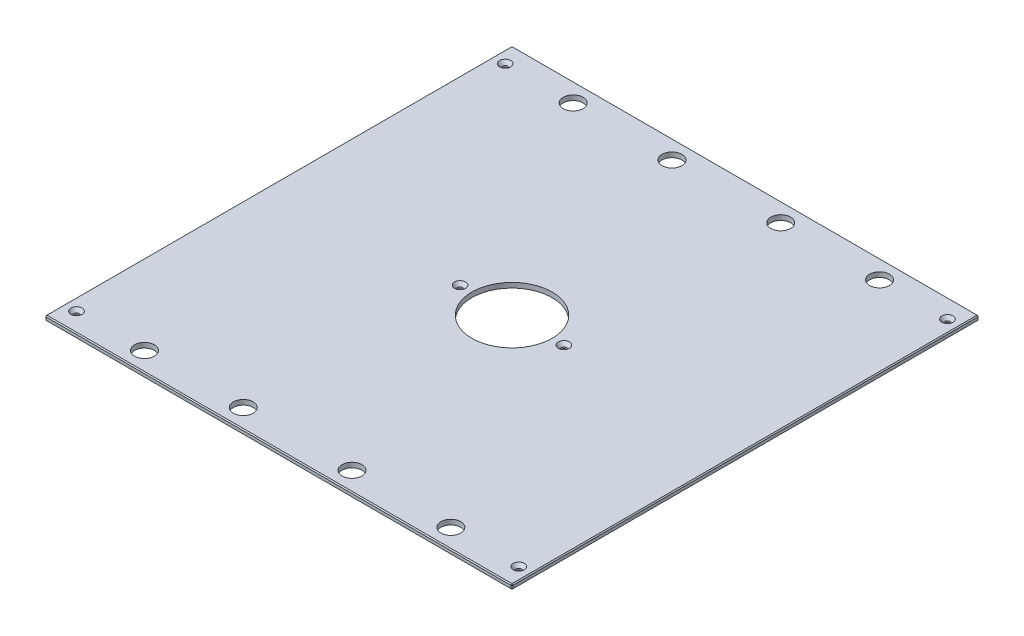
ISO-10303-21;
HEADER;
FILE_DESCRIPTION(('STEP AP214'),'2;1');
FILE_NAME('part.step','',(''),(''),'','','');
FILE_SCHEMA(('AUTOMOTIVE_DESIGN { 1 0 10303 214 1 1 1 1 }'));
ENDSEC;
DATA;
#1=APPLICATION_CONTEXT('core data for automotive mechanical design processes');
#2=APPLICATION_PROTOCOL_DEFINITION('international standard','automotive_design',2000,#1);
#3=PRODUCT_CONTEXT('',#1,'mechanical');
#4=PRODUCT('Part','Part','',(#3));
#5=PRODUCT_RELATED_PRODUCT_CATEGORY('part','',(#4));
#6=PRODUCT_DEFINITION_FORMATION('','',#4);
#7=PRODUCT_DEFINITION_CONTEXT('part definition',#1,'design');
#8=PRODUCT_DEFINITION('design','',#6,#7);
#9=PRODUCT_DEFINITION_SHAPE('','',#8);
#10=(LENGTH_UNIT() NAMED_UNIT(*) SI_UNIT(.MILLI.,.METRE.));
#11=(NAMED_UNIT(*) PLANE_ANGLE_UNIT() SI_UNIT($,.RADIAN.));
#12=(NAMED_UNIT(*) SI_UNIT($,.STERADIAN.) SOLID_ANGLE_UNIT());
#13=UNCERTAINTY_MEASURE_WITH_UNIT(LENGTH_MEASURE(1.E-05),#10,'distance_accuracy_value','');
#14=(GEOMETRIC_REPRESENTATION_CONTEXT(3) GLOBAL_UNCERTAINTY_ASSIGNED_CONTEXT((#13)) GLOBAL_UNIT_ASSIGNED_CONTEXT((#10,
#11,#12)) REPRESENTATION_CONTEXT('',''));
#15=CARTESIAN_POINT('',(0.,0.,0.));
#16=DIRECTION('',(0.,0.,1.));
#17=DIRECTION('',(1.,0.,0.));
#18=AXIS2_PLACEMENT_3D('',#15,#16,#17);
#19=CARTESIAN_POINT('',(-300.0375,6.35,-300.0375));
#20=DIRECTION('',(1.,0.,0.));
#21=DIRECTION('',(0.,0.,-1.));
#22=AXIS2_PLACEMENT_3D('',#19,#20,#21);
#23=PLANE('',#22);
#24=DIRECTION('',(0.,0.,-1.));
#25=VECTOR('',#24,1.);
#26=CARTESIAN_POINT('',(-300.0375,5.08000000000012,-300.0375));
#27=LINE('',#26,#25);
#28=CARTESIAN_POINT('',(-300.0375,5.08000000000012,298.7675));
#29=VERTEX_POINT('',#28);
#30=CARTESIAN_POINT('',(-300.0375,5.08000000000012,-298.7675));
#31=VERTEX_POINT('',#30);
#32=EDGE_CURVE('E134',#29,#31,#27,.T.);
#33=ORIENTED_EDGE('',*,*,#32,.T.);
#34=DIRECTION('',(0.,-1.,0.));
#35=VECTOR('',#34,1.);
#36=CARTESIAN_POINT('',(-300.0375,6.35,-298.7675));
#37=LINE('',#36,#35);
#38=CARTESIAN_POINT('',(-300.0375,1.26999999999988,-298.7675));
#39=VERTEX_POINT('',#38);
#40=EDGE_CURVE('E130',#31,#39,#37,.T.);
#41=ORIENTED_EDGE('',*,*,#40,.T.);
#42=DIRECTION('',(0.,0.,1.));
#43=VECTOR('',#42,1.);
#44=CARTESIAN_POINT('',(-300.0375,1.26999999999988,-300.0375));
#45=LINE('',#44,#43);
#46=CARTESIAN_POINT('',(-300.0375,1.26999999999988,298.7675));
#47=VERTEX_POINT('',#46);
#48=EDGE_CURVE('E125',#39,#47,#45,.T.);
#49=ORIENTED_EDGE('',*,*,#48,.T.);
#50=DIRECTION('',(0.,1.,0.));
#51=VECTOR('',#50,1.);
#52=CARTESIAN_POINT('',(-300.0375,6.35,298.7675));
#53=LINE('',#52,#51);
#54=EDGE_CURVE('E127',#47,#29,#53,.T.);
#55=ORIENTED_EDGE('',*,*,#54,.T.);
#56=EDGE_LOOP('',(#33,#41,#49,#55));
#57=FACE_BOUND('',#56,.T.);
#58=ADVANCED_FACE('F34',(#57),#23,.F.);
#59=CARTESIAN_POINT('',(-300.0375,6.35,300.0375));
#60=DIRECTION('',(0.,0.,-1.));
#61=DIRECTION('',(-1.,0.,0.));
#62=AXIS2_PLACEMENT_3D('',#59,#60,#61);
#63=PLANE('',#62);
#64=DIRECTION('',(1.,0.,0.));
#65=VECTOR('',#64,1.);
#66=CARTESIAN_POINT('',(-300.0375,1.26999999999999,300.0375));
#67=LINE('',#66,#65);
#68=CARTESIAN_POINT('',(-298.7675,1.26999999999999,300.0375));
#69=VERTEX_POINT('',#68);
#70=CARTESIAN_POINT('',(298.7675,1.26999999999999,300.0375));
#71=VERTEX_POINT('',#70);
#72=EDGE_CURVE('E57',#69,#71,#67,.T.);
#73=ORIENTED_EDGE('',*,*,#72,.T.);
#74=DIRECTION('',(0.,1.,0.));
#75=VECTOR('',#74,1.);
#76=CARTESIAN_POINT('',(298.7675,6.35,300.0375));
#77=LINE('',#76,#75);
#78=CARTESIAN_POINT('',(298.7675,5.08000000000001,300.0375));
#79=VERTEX_POINT('',#78);
#80=EDGE_CURVE('E11',#71,#79,#77,.T.);
#81=ORIENTED_EDGE('',*,*,#80,.T.);
#82=DIRECTION('',(-1.,0.,0.));
#83=VECTOR('',#82,1.);
#84=CARTESIAN_POINT('',(-300.0375,5.08000000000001,300.0375));
#85=LINE('',#84,#83);
#86=CARTESIAN_POINT('',(-298.7675,5.08000000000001,300.0375));
#87=VERTEX_POINT('',#86);
#88=EDGE_CURVE('E43',#79,#87,#85,.T.);
#89=ORIENTED_EDGE('',*,*,#88,.T.);
#90=DIRECTION('',(0.,-1.,0.));
#91=VECTOR('',#90,1.);
#92=CARTESIAN_POINT('',(-298.7675,6.35,300.0375));
#93=LINE('',#92,#91);
#94=EDGE_CURVE('E302',#87,#69,#93,.T.);
#95=ORIENTED_EDGE('',*,*,#94,.T.);
#96=EDGE_LOOP('',(#73,#81,#89,#95));
#97=FACE_BOUND('',#96,.T.);
#98=ADVANCED_FACE('F371',(#97),#63,.F.);
#99=CARTESIAN_POINT('',(300.0375,6.35,-300.0375));
#100=DIRECTION('',(-1.,0.,0.));
#101=DIRECTION('',(0.,0.,1.));
#102=AXIS2_PLACEMENT_3D('',#99,#100,#101);
#103=PLANE('',#102);
#104=DIRECTION('',(0.,0.,-1.));
#105=VECTOR('',#104,1.);
#106=CARTESIAN_POINT('',(300.0375,1.26999999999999,-300.0375));
#107=LINE('',#106,#105);
#108=CARTESIAN_POINT('',(300.0375,1.26999999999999,298.7675));
#109=VERTEX_POINT('',#108);
#110=CARTESIAN_POINT('',(300.0375,1.26999999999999,-298.7675));
#111=VERTEX_POINT('',#110);
#112=EDGE_CURVE('E297',#109,#111,#107,.T.);
#113=ORIENTED_EDGE('',*,*,#112,.T.);
#114=DIRECTION('',(0.,1.,0.));
#115=VECTOR('',#114,1.);
#116=CARTESIAN_POINT('',(300.0375,6.35,-298.7675));
#117=LINE('',#116,#115);
#118=CARTESIAN_POINT('',(300.0375,5.08000000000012,-298.7675));
#119=VERTEX_POINT('',#118);
#120=EDGE_CURVE('E299',#111,#119,#117,.T.);
#121=ORIENTED_EDGE('',*,*,#120,.T.);
#122=DIRECTION('',(0.,0.,1.));
#123=VECTOR('',#122,1.);
#124=CARTESIAN_POINT('',(300.0375,5.08000000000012,300.0375));
#125=LINE('',#124,#123);
#126=CARTESIAN_POINT('',(300.0375,5.08000000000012,298.7675));
#127=VERTEX_POINT('',#126);
#128=EDGE_CURVE('E295',#119,#127,#125,.T.);
#129=ORIENTED_EDGE('',*,*,#128,.T.);
#130=DIRECTION('',(0.,-1.,0.));
#131=VECTOR('',#130,1.);
#132=CARTESIAN_POINT('',(300.0375,6.35,298.7675));
#133=LINE('',#132,#131);
#134=EDGE_CURVE('E293',#127,#109,#133,.T.);
#135=ORIENTED_EDGE('',*,*,#134,.T.);
#136=EDGE_LOOP('',(#113,#121,#129,#135));
#137=FACE_BOUND('',#136,.T.);
#138=ADVANCED_FACE('F358',(#137),#103,.F.);
#139=CARTESIAN_POINT('',(-300.0375,6.35,-300.0375));
#140=DIRECTION('',(0.,0.,1.));
#141=DIRECTION('',(1.,0.,0.));
#142=AXIS2_PLACEMENT_3D('',#139,#140,#141);
#143=PLANE('',#142);
#144=DIRECTION('',(-1.,0.,0.));
#145=VECTOR('',#144,1.);
#146=CARTESIAN_POINT('',(-300.0375,1.26999999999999,-300.0375));
#147=LINE('',#146,#145);
#148=CARTESIAN_POINT('',(298.7675,1.26999999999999,-300.0375));
#149=VERTEX_POINT('',#148);
#150=CARTESIAN_POINT('',(-298.7675,1.26999999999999,-300.0375));
#151=VERTEX_POINT('',#150);
#152=EDGE_CURVE('E269',#149,#151,#147,.T.);
#153=ORIENTED_EDGE('',*,*,#152,.T.);
#154=DIRECTION('',(0.,1.,0.));
#155=VECTOR('',#154,1.);
#156=CARTESIAN_POINT('',(-298.7675,6.35,-300.0375));
#157=LINE('',#156,#155);
#158=CARTESIAN_POINT('',(-298.7675,5.08000000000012,-300.0375));
#159=VERTEX_POINT('',#158);
#160=EDGE_CURVE('E273',#151,#159,#157,.T.);
#161=ORIENTED_EDGE('',*,*,#160,.T.);
#162=DIRECTION('',(1.,0.,0.));
#163=VECTOR('',#162,1.);
#164=CARTESIAN_POINT('',(300.0375,5.08000000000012,-300.0375));
#165=LINE('',#164,#163);
#166=CARTESIAN_POINT('',(298.7675,5.08000000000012,-300.0375));
#167=VERTEX_POINT('',#166);
#168=EDGE_CURVE('E271',#159,#167,#165,.T.);
#169=ORIENTED_EDGE('',*,*,#168,.T.);
#170=DIRECTION('',(0.,-1.,0.));
#171=VECTOR('',#170,1.);
#172=CARTESIAN_POINT('',(298.7675,6.35,-300.0375));
#173=LINE('',#172,#171);
#174=EDGE_CURVE('E267',#167,#149,#173,.T.);
#175=ORIENTED_EDGE('',*,*,#174,.T.);
#176=EDGE_LOOP('',(#153,#161,#169,#175));
#177=FACE_BOUND('',#176,.T.);
#178=ADVANCED_FACE('F332',(#177),#143,.F.);
#179=CARTESIAN_POINT('',(0.,6.35,0.));
#180=DIRECTION('',(0.,1.,0.));
#181=DIRECTION('',(0.,0.,1.));
#182=AXIS2_PLACEMENT_3D('',#179,#180,#181);
#183=PLANE('',#182);
#184=CARTESIAN_POINT('',(284.1625,6.35,-275.42998));
#185=DIRECTION('',(0.,1.,0.));
#186=DIRECTION('',(0.,0.,1.));
#187=AXIS2_PLACEMENT_3D('',#184,#185,#186);
#188=CIRCLE('',#187,7.13740000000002);
#189=CARTESIAN_POINT('',(284.1625,6.35,-268.29258));
#190=VERTEX_POINT('',#189);
#191=EDGE_CURVE('E815',#190,#190,#188,.T.);
#192=ORIENTED_EDGE('',*,*,#191,.F.);
#193=EDGE_LOOP('',(#192));
#194=FACE_BOUND('',#193,.T.);
#195=CARTESIAN_POINT('',(284.1625,6.35,275.42998));
#196=DIRECTION('',(0.,1.,0.));
#197=DIRECTION('',(0.,0.,1.));
#198=AXIS2_PLACEMENT_3D('',#195,#196,#197);
#199=CIRCLE('',#198,7.13740000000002);
#200=CARTESIAN_POINT('',(284.1625,6.35,282.56738));
#201=VERTEX_POINT('',#200);
#202=EDGE_CURVE('E819',#201,#201,#199,.T.);
#203=ORIENTED_EDGE('',*,*,#202,.F.);
#204=EDGE_LOOP('',(#203));
#205=FACE_BOUND('',#204,.T.);
#206=CARTESIAN_POINT('',(-284.1625,6.35,275.42998));
#207=DIRECTION('',(0.,1.,0.));
#208=DIRECTION('',(0.,0.,1.));
#209=AXIS2_PLACEMENT_3D('',#206,#207,#208);
#210=CIRCLE('',#209,7.13740000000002);
#211=CARTESIAN_POINT('',(-284.1625,6.35,282.56738));
#212=VERTEX_POINT('',#211);
#213=EDGE_CURVE('E823',#212,#212,#210,.T.);
#214=ORIENTED_EDGE('',*,*,#213,.F.);
#215=EDGE_LOOP('',(#214));
#216=FACE_BOUND('',#215,.T.);
#217=CARTESIAN_POINT('',(-66.675,6.35,0.));
#218=DIRECTION('',(0.,1.,0.));
#219=DIRECTION('',(0.,0.,1.));
#220=AXIS2_PLACEMENT_3D('',#217,#218,#219);
#221=CIRCLE('',#220,7.1374);
#222=CARTESIAN_POINT('',(-66.675,6.35,7.1374));
#223=VERTEX_POINT('',#222);
#224=EDGE_CURVE('E827',#223,#223,#221,.T.);
#225=ORIENTED_EDGE('',*,*,#224,.F.);
#226=EDGE_LOOP('',(#225));
#227=FACE_BOUND('',#226,.T.);
#228=CARTESIAN_POINT('',(66.675,6.35,0.));
#229=DIRECTION('',(0.,1.,0.));
#230=DIRECTION('',(0.,0.,1.));
#231=AXIS2_PLACEMENT_3D('',#228,#229,#230);
#232=CIRCLE('',#231,7.1374);
#233=CARTESIAN_POINT('',(66.675,6.35,7.1374));
#234=VERTEX_POINT('',#233);
#235=EDGE_CURVE('E831',#234,#234,#232,.T.);
#236=ORIENTED_EDGE('',*,*,#235,.F.);
#237=EDGE_LOOP('',(#236));
#238=FACE_BOUND('',#237,.T.);
#239=CARTESIAN_POINT('',(-284.1625,6.35,-275.42998));
#240=DIRECTION('',(0.,1.,0.));
#241=DIRECTION('',(0.,0.,1.));
#242=AXIS2_PLACEMENT_3D('',#239,#240,#241);
#243=CIRCLE('',#242,7.13740000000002);
#244=CARTESIAN_POINT('',(-284.1625,6.35,-268.29258));
#245=VERTEX_POINT('',#244);
#246=EDGE_CURVE('E834',#245,#245,#243,.T.);
#247=ORIENTED_EDGE('',*,*,#246,.F.);
#248=EDGE_LOOP('',(#247));
#249=FACE_BOUND('',#248,.T.);
#250=DIRECTION('',(0.,0.,-1.));
#251=VECTOR('',#250,1.);
#252=CARTESIAN_POINT('',(298.7675,6.35,-300.0375));
#253=LINE('',#252,#251);
#254=CARTESIAN_POINT('',(298.7675,6.35,298.7675));
#255=VERTEX_POINT('',#254);
#256=CARTESIAN_POINT('',(298.7675,6.35,-298.7675));
#257=VERTEX_POINT('',#256);
#258=EDGE_CURVE('E280',#255,#257,#253,.T.);
#259=ORIENTED_EDGE('',*,*,#258,.T.);
#260=DIRECTION('',(-1.,0.,0.));
#261=VECTOR('',#260,1.);
#262=CARTESIAN_POINT('',(-300.0375,6.35,-298.7675));
#263=LINE('',#262,#261);
#264=CARTESIAN_POINT('',(-298.7675,6.35,-298.7675));
#265=VERTEX_POINT('',#264);
#266=EDGE_CURVE('E282',#257,#265,#263,.T.);
#267=ORIENTED_EDGE('',*,*,#266,.T.);
#268=DIRECTION('',(0.,0.,1.));
#269=VECTOR('',#268,1.);
#270=CARTESIAN_POINT('',(-298.7675,6.35,300.0375));
#271=LINE('',#270,#269);
#272=CARTESIAN_POINT('',(-298.7675,6.35,298.7675));
#273=VERTEX_POINT('',#272);
#274=EDGE_CURVE('E278',#265,#273,#271,.T.);
#275=ORIENTED_EDGE('',*,*,#274,.T.);
#276=DIRECTION('',(1.,0.,0.));
#277=VECTOR('',#276,1.);
#278=CARTESIAN_POINT('',(300.0375,6.35,298.7675));
#279=LINE('',#278,#277);
#280=EDGE_CURVE('E276',#273,#255,#279,.T.);
#281=ORIENTED_EDGE('',*,*,#280,.T.);
#282=EDGE_LOOP('',(#259,#267,#275,#281));
#283=FACE_BOUND('',#282,.T.);
#284=CARTESIAN_POINT('',(196.85,6.35,-275.42998));
#285=DIRECTION('',(0.,1.,0.));
#286=DIRECTION('',(0.,0.,1.));
#287=AXIS2_PLACEMENT_3D('',#284,#285,#286);
#288=CIRCLE('',#287,12.7);
#289=CARTESIAN_POINT('',(196.85,6.35,-262.72998));
#290=VERTEX_POINT('',#289);
#291=EDGE_CURVE('E203',#290,#290,#288,.T.);
#292=ORIENTED_EDGE('',*,*,#291,.F.);
#293=EDGE_LOOP('',(#292));
#294=FACE_BOUND('',#293,.T.);
#295=CARTESIAN_POINT('',(-196.85,6.35,-275.42998));
#296=DIRECTION('',(0.,1.,0.));
#297=DIRECTION('',(0.,0.,1.));
#298=AXIS2_PLACEMENT_3D('',#295,#296,#297);
#299=CIRCLE('',#298,12.7);
#300=CARTESIAN_POINT('',(-196.85,6.35,-262.72998));
#301=VERTEX_POINT('',#300);
#302=EDGE_CURVE('E213',#301,#301,#299,.T.);
#303=ORIENTED_EDGE('',*,*,#302,.F.);
#304=EDGE_LOOP('',(#303));
#305=FACE_BOUND('',#304,.T.);
#306=CARTESIAN_POINT('',(196.85,6.35,275.42998));
#307=DIRECTION('',(0.,1.,0.));
#308=DIRECTION('',(0.,0.,1.));
#309=AXIS2_PLACEMENT_3D('',#306,#307,#308);
#310=CIRCLE('',#309,12.7);
#311=CARTESIAN_POINT('',(196.85,6.35,288.12998));
#312=VERTEX_POINT('',#311);
#313=EDGE_CURVE('E224',#312,#312,#310,.T.);
#314=ORIENTED_EDGE('',*,*,#313,.F.);
#315=EDGE_LOOP('',(#314));
#316=FACE_BOUND('',#315,.T.);
#317=CARTESIAN_POINT('',(-196.85,6.35,275.42998));
#318=DIRECTION('',(0.,1.,0.));
#319=DIRECTION('',(0.,0.,1.));
#320=AXIS2_PLACEMENT_3D('',#317,#318,#319);
#321=CIRCLE('',#320,12.7);
#322=CARTESIAN_POINT('',(-196.85,6.35,288.12998));
#323=VERTEX_POINT('',#322);
#324=EDGE_CURVE('E230',#323,#323,#321,.T.);
#325=ORIENTED_EDGE('',*,*,#324,.F.);
#326=EDGE_LOOP('',(#325));
#327=FACE_BOUND('',#326,.T.);
#328=CARTESIAN_POINT('',(-69.85,6.35,-275.42998));
#329=DIRECTION('',(0.,1.,0.));
#330=DIRECTION('',(0.,0.,1.));
#331=AXIS2_PLACEMENT_3D('',#328,#329,#330);
#332=CIRCLE('',#331,12.7);
#333=CARTESIAN_POINT('',(-69.85,6.35,-262.72998));
#334=VERTEX_POINT('',#333);
#335=EDGE_CURVE('E236',#334,#334,#332,.T.);
#336=ORIENTED_EDGE('',*,*,#335,.F.);
#337=EDGE_LOOP('',(#336));
#338=FACE_BOUND('',#337,.T.);
#339=CARTESIAN_POINT('',(69.85,6.35,-275.42998));
#340=DIRECTION('',(0.,1.,0.));
#341=DIRECTION('',(0.,0.,1.));
#342=AXIS2_PLACEMENT_3D('',#339,#340,#341);
#343=CIRCLE('',#342,12.7);
#344=CARTESIAN_POINT('',(69.85,6.35,-262.72998));
#345=VERTEX_POINT('',#344);
#346=EDGE_CURVE('E242',#345,#345,#343,.T.);
#347=ORIENTED_EDGE('',*,*,#346,.F.);
#348=EDGE_LOOP('',(#347));
#349=FACE_BOUND('',#348,.T.);
#350=CARTESIAN_POINT('',(69.85,6.35,275.42998));
#351=DIRECTION('',(0.,1.,0.));
#352=DIRECTION('',(0.,0.,1.));
#353=AXIS2_PLACEMENT_3D('',#350,#351,#352);
#354=CIRCLE('',#353,12.7);
#355=CARTESIAN_POINT('',(69.85,6.35,288.12998));
#356=VERTEX_POINT('',#355);
#357=EDGE_CURVE('E248',#356,#356,#354,.T.);
#358=ORIENTED_EDGE('',*,*,#357,.F.);
#359=EDGE_LOOP('',(#358));
#360=FACE_BOUND('',#359,.T.);
#361=CARTESIAN_POINT('',(-69.85,6.35,275.42998));
#362=DIRECTION('',(0.,1.,0.));
#363=DIRECTION('',(0.,0.,1.));
#364=AXIS2_PLACEMENT_3D('',#361,#362,#363);
#365=CIRCLE('',#364,12.7);
#366=CARTESIAN_POINT('',(-69.85,6.35,288.12998));
#367=VERTEX_POINT('',#366);
#368=EDGE_CURVE('E254',#367,#367,#365,.T.);
#369=ORIENTED_EDGE('',*,*,#368,.F.);
#370=EDGE_LOOP('',(#369));
#371=FACE_BOUND('',#370,.T.);
#372=CARTESIAN_POINT('',(0.,6.35,0.));
#373=DIRECTION('',(0.,1.,0.));
#374=DIRECTION('',(0.,0.,1.));
#375=AXIS2_PLACEMENT_3D('',#372,#373,#374);
#376=CIRCLE('',#375,51.562);
#377=CARTESIAN_POINT('',(0.,6.35,51.562));
#378=VERTEX_POINT('',#377);
#379=EDGE_CURVE('E260',#378,#378,#376,.T.);
#380=ORIENTED_EDGE('',*,*,#379,.F.);
#381=EDGE_LOOP('',(#380));
#382=FACE_BOUND('',#381,.T.);
#383=ADVANCED_FACE('F380',(#194,#205,#216,#227,#238,#249,#283,#294,#305,#316,#327,#338,#349,
#360,#371,#382),#183,.T.);
#384=CARTESIAN_POINT('',(0.,0.,0.));
#385=DIRECTION('',(0.,1.,0.));
#386=DIRECTION('',(0.,0.,1.));
#387=AXIS2_PLACEMENT_3D('',#384,#385,#386);
#388=PLANE('',#387);
#389=CARTESIAN_POINT('',(284.1625,0.,-275.42998));
#390=DIRECTION('',(0.,1.,0.));
#391=DIRECTION('',(0.,0.,1.));
#392=AXIS2_PLACEMENT_3D('',#389,#390,#391);
#393=CIRCLE('',#392,3.3782);
#394=CARTESIAN_POINT('',(284.1625,0.,-272.05178));
#395=VERTEX_POINT('',#394);
#396=EDGE_CURVE('E868',#395,#395,#393,.T.);
#397=ORIENTED_EDGE('',*,*,#396,.T.);
#398=EDGE_LOOP('',(#397));
#399=FACE_BOUND('',#398,.T.);
#400=CARTESIAN_POINT('',(284.1625,0.,275.42998));
#401=DIRECTION('',(0.,1.,0.));
#402=DIRECTION('',(0.,0.,1.));
#403=AXIS2_PLACEMENT_3D('',#400,#401,#402);
#404=CIRCLE('',#403,3.3782);
#405=CARTESIAN_POINT('',(284.1625,0.,278.80818));
#406=VERTEX_POINT('',#405);
#407=EDGE_CURVE('E861',#406,#406,#404,.T.);
#408=ORIENTED_EDGE('',*,*,#407,.T.);
#409=EDGE_LOOP('',(#408));
#410=FACE_BOUND('',#409,.T.);
#411=CARTESIAN_POINT('',(-284.1625,0.,275.42998));
#412=DIRECTION('',(0.,1.,0.));
#413=DIRECTION('',(0.,0.,1.));
#414=AXIS2_PLACEMENT_3D('',#411,#412,#413);
#415=CIRCLE('',#414,3.3782);
#416=CARTESIAN_POINT('',(-284.1625,0.,278.80818));
#417=VERTEX_POINT('',#416);
#418=EDGE_CURVE('E854',#417,#417,#415,.T.);
#419=ORIENTED_EDGE('',*,*,#418,.T.);
#420=EDGE_LOOP('',(#419));
#421=FACE_BOUND('',#420,.T.);
#422=CARTESIAN_POINT('',(-66.675,0.,0.));
#423=DIRECTION('',(0.,1.,0.));
#424=DIRECTION('',(0.,0.,1.));
#425=AXIS2_PLACEMENT_3D('',#422,#423,#424);
#426=CIRCLE('',#425,3.3782);
#427=CARTESIAN_POINT('',(-66.675,0.,3.3782));
#428=VERTEX_POINT('',#427);
#429=EDGE_CURVE('E847',#428,#428,#426,.T.);
#430=ORIENTED_EDGE('',*,*,#429,.T.);
#431=EDGE_LOOP('',(#430));
#432=FACE_BOUND('',#431,.T.);
#433=CARTESIAN_POINT('',(66.675,0.,0.));
#434=DIRECTION('',(0.,1.,0.));
#435=DIRECTION('',(0.,0.,1.));
#436=AXIS2_PLACEMENT_3D('',#433,#434,#435);
#437=CIRCLE('',#436,3.3782);
#438=CARTESIAN_POINT('',(66.675,0.,3.3782));
#439=VERTEX_POINT('',#438);
#440=EDGE_CURVE('E837',#439,#439,#437,.T.);
#441=ORIENTED_EDGE('',*,*,#440,.T.);
#442=EDGE_LOOP('',(#441));
#443=FACE_BOUND('',#442,.T.);
#444=CARTESIAN_POINT('',(-284.1625,0.,-275.42998));
#445=DIRECTION('',(0.,1.,0.));
#446=DIRECTION('',(0.,0.,1.));
#447=AXIS2_PLACEMENT_3D('',#444,#445,#446);
#448=CIRCLE('',#447,3.3782);
#449=CARTESIAN_POINT('',(-284.1625,0.,-272.05178));
#450=VERTEX_POINT('',#449);
#451=EDGE_CURVE('E216',#450,#450,#448,.T.);
#452=ORIENTED_EDGE('',*,*,#451,.T.);
#453=EDGE_LOOP('',(#452));
#454=FACE_BOUND('',#453,.T.);
#455=DIRECTION('',(0.,0.,-1.));
#456=VECTOR('',#455,1.);
#457=CARTESIAN_POINT('',(-298.7675,0.,0.));
#458=LINE('',#457,#456);
#459=CARTESIAN_POINT('',(-298.7675,0.,298.7675));
#460=VERTEX_POINT('',#459);
#461=CARTESIAN_POINT('',(-298.7675,0.,-298.7675));
#462=VERTEX_POINT('',#461);
#463=EDGE_CURVE('E157',#460,#462,#458,.T.);
#464=ORIENTED_EDGE('',*,*,#463,.T.);
#465=DIRECTION('',(1.,0.,0.));
#466=VECTOR('',#465,1.);
#467=CARTESIAN_POINT('',(0.,0.,-298.7675));
#468=LINE('',#467,#466);
#469=CARTESIAN_POINT('',(298.7675,0.,-298.7675));
#470=VERTEX_POINT('',#469);
#471=EDGE_CURVE('E290',#462,#470,#468,.T.);
#472=ORIENTED_EDGE('',*,*,#471,.T.);
#473=DIRECTION('',(0.,0.,1.));
#474=VECTOR('',#473,1.);
#475=CARTESIAN_POINT('',(298.7675,0.,0.));
#476=LINE('',#475,#474);
#477=CARTESIAN_POINT('',(298.7675,0.,298.7675));
#478=VERTEX_POINT('',#477);
#479=EDGE_CURVE('E288',#470,#478,#476,.T.);
#480=ORIENTED_EDGE('',*,*,#479,.T.);
#481=DIRECTION('',(-1.,0.,0.));
#482=VECTOR('',#481,1.);
#483=CARTESIAN_POINT('',(0.,0.,298.7675));
#484=LINE('',#483,#482);
#485=EDGE_CURVE('E285',#478,#460,#484,.T.);
#486=ORIENTED_EDGE('',*,*,#485,.T.);
#487=EDGE_LOOP('',(#464,#472,#480,#486));
#488=FACE_BOUND('',#487,.T.);
#489=CARTESIAN_POINT('',(196.85,0.,-275.42998));
#490=DIRECTION('',(0.,1.,0.));
#491=DIRECTION('',(0.,0.,1.));
#492=AXIS2_PLACEMENT_3D('',#489,#490,#491);
#493=CIRCLE('',#492,12.7);
#494=CARTESIAN_POINT('',(196.85,0.,-262.72998));
#495=VERTEX_POINT('',#494);
#496=EDGE_CURVE('E208',#495,#495,#493,.T.);
#497=ORIENTED_EDGE('',*,*,#496,.T.);
#498=EDGE_LOOP('',(#497));
#499=FACE_BOUND('',#498,.T.);
#500=CARTESIAN_POINT('',(-196.85,0.,-275.42998));
#501=DIRECTION('',(0.,1.,0.));
#502=DIRECTION('',(0.,0.,1.));
#503=AXIS2_PLACEMENT_3D('',#500,#501,#502);
#504=CIRCLE('',#503,12.7);
#505=CARTESIAN_POINT('',(-196.85,0.,-262.72998));
#506=VERTEX_POINT('',#505);
#507=EDGE_CURVE('E221',#506,#506,#504,.T.);
#508=ORIENTED_EDGE('',*,*,#507,.T.);
#509=EDGE_LOOP('',(#508));
#510=FACE_BOUND('',#509,.T.);
#511=CARTESIAN_POINT('',(196.85,0.,275.42998));
#512=DIRECTION('',(0.,1.,0.));
#513=DIRECTION('',(0.,0.,1.));
#514=AXIS2_PLACEMENT_3D('',#511,#512,#513);
#515=CIRCLE('',#514,12.7);
#516=CARTESIAN_POINT('',(196.85,0.,288.12998));
#517=VERTEX_POINT('',#516);
#518=EDGE_CURVE('E227',#517,#517,#515,.T.);
#519=ORIENTED_EDGE('',*,*,#518,.T.);
#520=EDGE_LOOP('',(#519));
#521=FACE_BOUND('',#520,.T.);
#522=CARTESIAN_POINT('',(-196.85,0.,275.42998));
#523=DIRECTION('',(0.,1.,0.));
#524=DIRECTION('',(0.,0.,1.));
#525=AXIS2_PLACEMENT_3D('',#522,#523,#524);
#526=CIRCLE('',#525,12.7);
#527=CARTESIAN_POINT('',(-196.85,0.,288.12998));
#528=VERTEX_POINT('',#527);
#529=EDGE_CURVE('E233',#528,#528,#526,.T.);
#530=ORIENTED_EDGE('',*,*,#529,.T.);
#531=EDGE_LOOP('',(#530));
#532=FACE_BOUND('',#531,.T.);
#533=CARTESIAN_POINT('',(-69.85,0.,-275.42998));
#534=DIRECTION('',(0.,1.,0.));
#535=DIRECTION('',(0.,0.,1.));
#536=AXIS2_PLACEMENT_3D('',#533,#534,#535);
#537=CIRCLE('',#536,12.7);
#538=CARTESIAN_POINT('',(-69.85,0.,-262.72998));
#539=VERTEX_POINT('',#538);
#540=EDGE_CURVE('E239',#539,#539,#537,.T.);
#541=ORIENTED_EDGE('',*,*,#540,.T.);
#542=EDGE_LOOP('',(#541));
#543=FACE_BOUND('',#542,.T.);
#544=CARTESIAN_POINT('',(69.85,0.,-275.42998));
#545=DIRECTION('',(0.,1.,0.));
#546=DIRECTION('',(0.,0.,1.));
#547=AXIS2_PLACEMENT_3D('',#544,#545,#546);
#548=CIRCLE('',#547,12.7);
#549=CARTESIAN_POINT('',(69.85,0.,-262.72998));
#550=VERTEX_POINT('',#549);
#551=EDGE_CURVE('E245',#550,#550,#548,.T.);
#552=ORIENTED_EDGE('',*,*,#551,.T.);
#553=EDGE_LOOP('',(#552));
#554=FACE_BOUND('',#553,.T.);
#555=CARTESIAN_POINT('',(69.85,0.,275.42998));
#556=DIRECTION('',(0.,1.,0.));
#557=DIRECTION('',(0.,0.,1.));
#558=AXIS2_PLACEMENT_3D('',#555,#556,#557);
#559=CIRCLE('',#558,12.7);
#560=CARTESIAN_POINT('',(69.85,0.,288.12998));
#561=VERTEX_POINT('',#560);
#562=EDGE_CURVE('E251',#561,#561,#559,.T.);
#563=ORIENTED_EDGE('',*,*,#562,.T.);
#564=EDGE_LOOP('',(#563));
#565=FACE_BOUND('',#564,.T.);
#566=CARTESIAN_POINT('',(-69.85,0.,275.42998));
#567=DIRECTION('',(0.,1.,0.));
#568=DIRECTION('',(0.,0.,1.));
#569=AXIS2_PLACEMENT_3D('',#566,#567,#568);
#570=CIRCLE('',#569,12.7);
#571=CARTESIAN_POINT('',(-69.85,0.,288.12998));
#572=VERTEX_POINT('',#571);
#573=EDGE_CURVE('E257',#572,#572,#570,.T.);
#574=ORIENTED_EDGE('',*,*,#573,.T.);
#575=EDGE_LOOP('',(#574));
#576=FACE_BOUND('',#575,.T.);
#577=CARTESIAN_POINT('',(0.,0.,0.));
#578=DIRECTION('',(0.,1.,0.));
#579=DIRECTION('',(0.,0.,1.));
#580=AXIS2_PLACEMENT_3D('',#577,#578,#579);
#581=CIRCLE('',#580,51.562);
#582=CARTESIAN_POINT('',(0.,0.,51.562));
#583=VERTEX_POINT('',#582);
#584=EDGE_CURVE('E146',#583,#583,#581,.T.);
#585=ORIENTED_EDGE('',*,*,#584,.T.);
#586=EDGE_LOOP('',(#585));
#587=FACE_BOUND('',#586,.T.);
#588=ADVANCED_FACE('F345',(#399,#410,#421,#432,#443,#454,#488,#499,#510,#521,#532,#543,#554,
#565,#576,#587),#388,.F.);
#589=CARTESIAN_POINT('',(0.,0.,0.));
#590=DIRECTION('',(0.,1.,0.));
#591=DIRECTION('',(0.,0.,1.));
#592=AXIS2_PLACEMENT_3D('',#589,#590,#591);
#593=CYLINDRICAL_SURFACE('',#592,51.562);
#594=ORIENTED_EDGE('',*,*,#584,.F.);
#595=EDGE_LOOP('',(#594));
#596=FACE_BOUND('',#595,.T.);
#597=ORIENTED_EDGE('',*,*,#379,.T.);
#598=EDGE_LOOP('',(#597));
#599=FACE_BOUND('',#598,.T.);
#600=ADVANCED_FACE('F750',(#596,#599),#593,.F.);
#601=CARTESIAN_POINT('',(-69.85,6.35,275.42998));
#602=DIRECTION('',(0.,1.,0.));
#603=DIRECTION('',(0.,0.,1.));
#604=AXIS2_PLACEMENT_3D('',#601,#602,#603);
#605=CYLINDRICAL_SURFACE('',#604,12.7);
#606=ORIENTED_EDGE('',*,*,#573,.F.);
#607=EDGE_LOOP('',(#606));
#608=FACE_BOUND('',#607,.T.);
#609=ORIENTED_EDGE('',*,*,#368,.T.);
#610=EDGE_LOOP('',(#609));
#611=FACE_BOUND('',#610,.T.);
#612=ADVANCED_FACE('F741',(#608,#611),#605,.F.);
#613=CARTESIAN_POINT('',(69.85,6.35,275.42998));
#614=DIRECTION('',(0.,1.,0.));
#615=DIRECTION('',(0.,0.,1.));
#616=AXIS2_PLACEMENT_3D('',#613,#614,#615);
#617=CYLINDRICAL_SURFACE('',#616,12.7);
#618=ORIENTED_EDGE('',*,*,#562,.F.);
#619=EDGE_LOOP('',(#618));
#620=FACE_BOUND('',#619,.T.);
#621=ORIENTED_EDGE('',*,*,#357,.T.);
#622=EDGE_LOOP('',(#621));
#623=FACE_BOUND('',#622,.T.);
#624=ADVANCED_FACE('F732',(#620,#623),#617,.F.);
#625=CARTESIAN_POINT('',(69.85,6.35,-275.42998));
#626=DIRECTION('',(0.,1.,0.));
#627=DIRECTION('',(0.,0.,1.));
#628=AXIS2_PLACEMENT_3D('',#625,#626,#627);
#629=CYLINDRICAL_SURFACE('',#628,12.7);
#630=ORIENTED_EDGE('',*,*,#551,.F.);
#631=EDGE_LOOP('',(#630));
#632=FACE_BOUND('',#631,.T.);
#633=ORIENTED_EDGE('',*,*,#346,.T.);
#634=EDGE_LOOP('',(#633));
#635=FACE_BOUND('',#634,.T.);
#636=ADVANCED_FACE('F723',(#632,#635),#629,.F.);
#637=CARTESIAN_POINT('',(-69.85,6.35,-275.42998));
#638=DIRECTION('',(0.,1.,0.));
#639=DIRECTION('',(0.,0.,1.));
#640=AXIS2_PLACEMENT_3D('',#637,#638,#639);
#641=CYLINDRICAL_SURFACE('',#640,12.7);
#642=ORIENTED_EDGE('',*,*,#540,.F.);
#643=EDGE_LOOP('',(#642));
#644=FACE_BOUND('',#643,.T.);
#645=ORIENTED_EDGE('',*,*,#335,.T.);
#646=EDGE_LOOP('',(#645));
#647=FACE_BOUND('',#646,.T.);
#648=ADVANCED_FACE('F714',(#644,#647),#641,.F.);
#649=CARTESIAN_POINT('',(-196.85,6.35,275.42998));
#650=DIRECTION('',(0.,1.,0.));
#651=DIRECTION('',(0.,0.,1.));
#652=AXIS2_PLACEMENT_3D('',#649,#650,#651);
#653=CYLINDRICAL_SURFACE('',#652,12.7);
#654=ORIENTED_EDGE('',*,*,#529,.F.);
#655=EDGE_LOOP('',(#654));
#656=FACE_BOUND('',#655,.T.);
#657=ORIENTED_EDGE('',*,*,#324,.T.);
#658=EDGE_LOOP('',(#657));
#659=FACE_BOUND('',#658,.T.);
#660=ADVANCED_FACE('F705',(#656,#659),#653,.F.);
#661=CARTESIAN_POINT('',(196.85,6.35,275.42998));
#662=DIRECTION('',(0.,1.,0.));
#663=DIRECTION('',(0.,0.,1.));
#664=AXIS2_PLACEMENT_3D('',#661,#662,#663);
#665=CYLINDRICAL_SURFACE('',#664,12.7);
#666=ORIENTED_EDGE('',*,*,#518,.F.);
#667=EDGE_LOOP('',(#666));
#668=FACE_BOUND('',#667,.T.);
#669=ORIENTED_EDGE('',*,*,#313,.T.);
#670=EDGE_LOOP('',(#669));
#671=FACE_BOUND('',#670,.T.);
#672=ADVANCED_FACE('F696',(#668,#671),#665,.F.);
#673=CARTESIAN_POINT('',(-196.85,6.35,-275.42998));
#674=DIRECTION('',(0.,1.,0.));
#675=DIRECTION('',(0.,0.,1.));
#676=AXIS2_PLACEMENT_3D('',#673,#674,#675);
#677=CYLINDRICAL_SURFACE('',#676,12.7);
#678=ORIENTED_EDGE('',*,*,#507,.F.);
#679=EDGE_LOOP('',(#678));
#680=FACE_BOUND('',#679,.T.);
#681=ORIENTED_EDGE('',*,*,#302,.T.);
#682=EDGE_LOOP('',(#681));
#683=FACE_BOUND('',#682,.T.);
#684=ADVANCED_FACE('F686',(#680,#683),#677,.F.);
#685=CARTESIAN_POINT('',(196.85,6.35,-275.42998));
#686=DIRECTION('',(0.,1.,0.));
#687=DIRECTION('',(0.,0.,1.));
#688=AXIS2_PLACEMENT_3D('',#685,#686,#687);
#689=CYLINDRICAL_SURFACE('',#688,12.7);
#690=ORIENTED_EDGE('',*,*,#496,.F.);
#691=EDGE_LOOP('',(#690));
#692=FACE_BOUND('',#691,.T.);
#693=ORIENTED_EDGE('',*,*,#291,.T.);
#694=EDGE_LOOP('',(#693));
#695=FACE_BOUND('',#694,.T.);
#696=ADVANCED_FACE('F389',(#692,#695),#689,.F.);
#697=CARTESIAN_POINT('',(300.0375,6.35,298.7675));
#698=DIRECTION('',(-0.707106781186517,0.,-0.707106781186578));
#699=DIRECTION('',(0.,-1.,0.));
#700=AXIS2_PLACEMENT_3D('',#697,#698,#699);
#701=PLANE('',#700);
#702=DIRECTION('',(-0.707106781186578,0.,0.707106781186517));
#703=VECTOR('',#702,1.);
#704=CARTESIAN_POINT('',(300.0375,5.08000000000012,298.7675));
#705=LINE('',#704,#703);
#706=EDGE_CURVE('E38',#79,#127,#705,.F.);
#707=ORIENTED_EDGE('',*,*,#706,.F.);
#708=ORIENTED_EDGE('',*,*,#80,.F.);
#709=DIRECTION('',(0.707106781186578,0.,-0.707106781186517));
#710=VECTOR('',#709,1.);
#711=CARTESIAN_POINT('',(299.4025,1.26999999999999,299.4025));
#712=LINE('',#711,#710);
#713=EDGE_CURVE('E196',#109,#71,#712,.F.);
#714=ORIENTED_EDGE('',*,*,#713,.F.);
#715=ORIENTED_EDGE('',*,*,#134,.F.);
#716=EDGE_LOOP('',(#707,#708,#714,#715));
#717=FACE_BOUND('',#716,.T.);
#718=ADVANCED_FACE('F36',(#717),#701,.F.);
#719=CARTESIAN_POINT('',(300.0375,5.08000000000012,298.7675));
#720=DIRECTION('',(0.577350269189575,0.577350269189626,0.577350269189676));
#721=DIRECTION('',(0.,-0.707106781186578,0.707106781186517));
#722=AXIS2_PLACEMENT_3D('',#719,#720,#721);
#723=PLANE('',#722);
#724=DIRECTION('',(0.,-0.707106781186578,0.707106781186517));
#725=VECTOR('',#724,1.);
#726=CARTESIAN_POINT('',(298.7675,5.715,299.4025));
#727=LINE('',#726,#725);
#728=EDGE_CURVE('E192',#79,#255,#727,.F.);
#729=ORIENTED_EDGE('',*,*,#728,.F.);
#730=ORIENTED_EDGE('',*,*,#706,.T.);
#731=DIRECTION('',(-0.707106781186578,0.707106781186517,0.));
#732=VECTOR('',#731,1.);
#733=CARTESIAN_POINT('',(300.0375,5.08000000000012,298.7675));
#734=LINE('',#733,#732);
#735=EDGE_CURVE('E194',#255,#127,#734,.F.);
#736=ORIENTED_EDGE('',*,*,#735,.F.);
#737=EDGE_LOOP('',(#729,#730,#736));
#738=FACE_BOUND('',#737,.T.);
#739=ADVANCED_FACE('F382',(#738),#723,.T.);
#740=CARTESIAN_POINT('',(298.7675,0.,298.7675));
#741=DIRECTION('',(0.577350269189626,-0.577350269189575,0.577350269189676));
#742=DIRECTION('',(0.707106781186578,0.,-0.707106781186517));
#743=AXIS2_PLACEMENT_3D('',#740,#741,#742);
#744=PLANE('',#743);
#745=DIRECTION('',(-0.707106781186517,-0.707106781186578,0.));
#746=VECTOR('',#745,1.);
#747=CARTESIAN_POINT('',(298.7675,0.,298.7675));
#748=LINE('',#747,#746);
#749=EDGE_CURVE('E186',#109,#478,#748,.T.);
#750=ORIENTED_EDGE('',*,*,#749,.F.);
#751=ORIENTED_EDGE('',*,*,#713,.T.);
#752=DIRECTION('',(0.,0.707106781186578,0.707106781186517));
#753=VECTOR('',#752,1.);
#754=CARTESIAN_POINT('',(298.7675,0.,298.7675));
#755=LINE('',#754,#753);
#756=EDGE_CURVE('E189',#478,#71,#755,.T.);
#757=ORIENTED_EDGE('',*,*,#756,.F.);
#758=EDGE_LOOP('',(#750,#751,#757));
#759=FACE_BOUND('',#758,.T.);
#760=ADVANCED_FACE('F351',(#759),#744,.T.);
#761=CARTESIAN_POINT('',(298.7675,6.35,0.));
#762=DIRECTION('',(0.707106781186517,0.707106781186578,0.));
#763=DIRECTION('',(0.,0.,1.));
#764=AXIS2_PLACEMENT_3D('',#761,#762,#763);
#765=PLANE('',#764);
#766=ORIENTED_EDGE('',*,*,#735,.T.);
#767=ORIENTED_EDGE('',*,*,#128,.F.);
#768=DIRECTION('',(0.707106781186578,-0.707106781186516,0.));
#769=VECTOR('',#768,1.);
#770=CARTESIAN_POINT('',(299.4025,5.71500000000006,-298.7675));
#771=LINE('',#770,#769);
#772=EDGE_CURVE('E181',#257,#119,#771,.T.);
#773=ORIENTED_EDGE('',*,*,#772,.F.);
#774=ORIENTED_EDGE('',*,*,#258,.F.);
#775=EDGE_LOOP('',(#766,#767,#773,#774));
#776=FACE_BOUND('',#775,.T.);
#777=ADVANCED_FACE('F368',(#776),#765,.T.);
#778=CARTESIAN_POINT('',(0.,6.35,298.7675));
#779=DIRECTION('',(0.,0.707106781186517,0.707106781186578));
#780=DIRECTION('',(-1.,0.,0.));
#781=AXIS2_PLACEMENT_3D('',#778,#779,#780);
#782=PLANE('',#781);
#783=ORIENTED_EDGE('',*,*,#728,.T.);
#784=ORIENTED_EDGE('',*,*,#280,.F.);
#785=DIRECTION('',(0.,0.707106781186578,-0.707106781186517));
#786=VECTOR('',#785,1.);
#787=CARTESIAN_POINT('',(-298.7675,6.35,298.7675));
#788=LINE('',#787,#786);
#789=EDGE_CURVE('E178',#87,#273,#788,.T.);
#790=ORIENTED_EDGE('',*,*,#789,.F.);
#791=ORIENTED_EDGE('',*,*,#88,.F.);
#792=EDGE_LOOP('',(#783,#784,#790,#791));
#793=FACE_BOUND('',#792,.T.);
#794=ADVANCED_FACE('F373',(#793),#782,.T.);
#795=CARTESIAN_POINT('',(-298.7675,6.35,300.0375));
#796=DIRECTION('',(0.707106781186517,0.,-0.707106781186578));
#797=DIRECTION('',(0.,-1.,0.));
#798=AXIS2_PLACEMENT_3D('',#795,#796,#797);
#799=PLANE('',#798);
#800=DIRECTION('',(0.707106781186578,0.,0.707106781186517));
#801=VECTOR('',#800,1.);
#802=CARTESIAN_POINT('',(-300.0375,1.26999999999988,298.7675));
#803=LINE('',#802,#801);
#804=EDGE_CURVE('E141',#69,#47,#803,.F.);
#805=ORIENTED_EDGE('',*,*,#804,.F.);
#806=ORIENTED_EDGE('',*,*,#94,.F.);
#807=DIRECTION('',(-0.707106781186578,0.,-0.707106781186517));
#808=VECTOR('',#807,1.);
#809=CARTESIAN_POINT('',(-299.4025,5.08000000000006,299.4025));
#810=LINE('',#809,#808);
#811=EDGE_CURVE('E144',#29,#87,#810,.F.);
#812=ORIENTED_EDGE('',*,*,#811,.F.);
#813=ORIENTED_EDGE('',*,*,#54,.F.);
#814=EDGE_LOOP('',(#805,#806,#812,#813));
#815=FACE_BOUND('',#814,.T.);
#816=ADVANCED_FACE('F139',(#815),#799,.F.);
#817=CARTESIAN_POINT('',(-300.0375,1.26999999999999,300.0375));
#818=DIRECTION('',(0.,0.707106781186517,-0.707106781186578));
#819=DIRECTION('',(1.,0.,0.));
#820=AXIS2_PLACEMENT_3D('',#817,#818,#819);
#821=PLANE('',#820);
#822=ORIENTED_EDGE('',*,*,#756,.T.);
#823=ORIENTED_EDGE('',*,*,#72,.F.);
#824=DIRECTION('',(0.,-0.707106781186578,-0.707106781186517));
#825=VECTOR('',#824,1.);
#826=CARTESIAN_POINT('',(-298.7675,0.634999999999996,299.4025));
#827=LINE('',#826,#825);
#828=EDGE_CURVE('E154',#460,#69,#827,.F.);
#829=ORIENTED_EDGE('',*,*,#828,.F.);
#830=ORIENTED_EDGE('',*,*,#485,.F.);
#831=EDGE_LOOP('',(#822,#823,#829,#830));
#832=FACE_BOUND('',#831,.T.);
#833=ADVANCED_FACE('F350',(#832),#821,.F.);
#834=CARTESIAN_POINT('',(300.0375,1.26999999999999,-300.0375));
#835=DIRECTION('',(-0.707106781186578,0.707106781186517,0.));
#836=DIRECTION('',(0.,0.,-1.));
#837=AXIS2_PLACEMENT_3D('',#834,#835,#836);
#838=PLANE('',#837);
#839=ORIENTED_EDGE('',*,*,#749,.T.);
#840=ORIENTED_EDGE('',*,*,#479,.F.);
#841=DIRECTION('',(0.707106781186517,0.707106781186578,0.));
#842=VECTOR('',#841,1.);
#843=CARTESIAN_POINT('',(298.7675,0.,-298.7675));
#844=LINE('',#843,#842);
#845=EDGE_CURVE('E173',#111,#470,#844,.F.);
#846=ORIENTED_EDGE('',*,*,#845,.F.);
#847=ORIENTED_EDGE('',*,*,#112,.F.);
#848=EDGE_LOOP('',(#839,#840,#846,#847));
#849=FACE_BOUND('',#848,.T.);
#850=ADVANCED_FACE('F355',(#849),#838,.F.);
#851=CARTESIAN_POINT('',(298.7675,6.35,-300.0375));
#852=DIRECTION('',(-0.707106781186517,0.,0.707106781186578));
#853=DIRECTION('',(0.,-1.,0.));
#854=AXIS2_PLACEMENT_3D('',#851,#852,#853);
#855=PLANE('',#854);
#856=DIRECTION('',(0.707106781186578,0.,0.707106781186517));
#857=VECTOR('',#856,1.);
#858=CARTESIAN_POINT('',(298.7675,5.08000000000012,-300.0375));
#859=LINE('',#858,#857);
#860=EDGE_CURVE('E183',#119,#167,#859,.F.);
#861=ORIENTED_EDGE('',*,*,#860,.F.);
#862=ORIENTED_EDGE('',*,*,#120,.F.);
#863=DIRECTION('',(-0.707106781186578,0.,-0.707106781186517));
#864=VECTOR('',#863,1.);
#865=CARTESIAN_POINT('',(299.4025,1.26999999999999,-299.4025));
#866=LINE('',#865,#864);
#867=EDGE_CURVE('E170',#149,#111,#866,.F.);
#868=ORIENTED_EDGE('',*,*,#867,.F.);
#869=ORIENTED_EDGE('',*,*,#174,.F.);
#870=EDGE_LOOP('',(#861,#862,#868,#869));
#871=FACE_BOUND('',#870,.T.);
#872=ADVANCED_FACE('F363',(#871),#855,.F.);
#873=CARTESIAN_POINT('',(298.7675,5.08000000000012,-300.0375));
#874=DIRECTION('',(0.577350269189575,0.577350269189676,-0.577350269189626));
#875=DIRECTION('',(0.,0.707106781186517,0.707106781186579));
#876=AXIS2_PLACEMENT_3D('',#873,#874,#875);
#877=PLANE('',#876);
#878=ORIENTED_EDGE('',*,*,#772,.T.);
#879=ORIENTED_EDGE('',*,*,#860,.T.);
#880=DIRECTION('',(0.,0.707106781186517,0.707106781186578));
#881=VECTOR('',#880,1.);
#882=CARTESIAN_POINT('',(298.7675,5.08000000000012,-300.0375));
#883=LINE('',#882,#881);
#884=EDGE_CURVE('E162',#257,#167,#883,.F.);
#885=ORIENTED_EDGE('',*,*,#884,.F.);
#886=EDGE_LOOP('',(#878,#879,#885));
#887=FACE_BOUND('',#886,.T.);
#888=ADVANCED_FACE('F421',(#887),#877,.T.);
#889=CARTESIAN_POINT('',(-298.7675,6.35,298.7675));
#890=DIRECTION('',(-0.577350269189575,0.577350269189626,0.577350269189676));
#891=DIRECTION('',(0.,-0.707106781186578,0.707106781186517));
#892=AXIS2_PLACEMENT_3D('',#889,#890,#891);
#893=PLANE('',#892);
#894=ORIENTED_EDGE('',*,*,#811,.T.);
#895=ORIENTED_EDGE('',*,*,#789,.T.);
#896=DIRECTION('',(-0.707106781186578,-0.707106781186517,0.));
#897=VECTOR('',#896,1.);
#898=CARTESIAN_POINT('',(-298.7675,6.35,298.7675));
#899=LINE('',#898,#897);
#900=EDGE_CURVE('E158',#29,#273,#899,.F.);
#901=ORIENTED_EDGE('',*,*,#900,.F.);
#902=EDGE_LOOP('',(#894,#895,#901));
#903=FACE_BOUND('',#902,.T.);
#904=ADVANCED_FACE('F375',(#903),#893,.T.);
#905=CARTESIAN_POINT('',(-300.0375,1.26999999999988,298.7675));
#906=DIRECTION('',(-0.577350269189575,-0.577350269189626,0.577350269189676));
#907=DIRECTION('',(0.,-0.707106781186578,-0.707106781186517));
#908=AXIS2_PLACEMENT_3D('',#905,#906,#907);
#909=PLANE('',#908);
#910=ORIENTED_EDGE('',*,*,#828,.T.);
#911=ORIENTED_EDGE('',*,*,#804,.T.);
#912=DIRECTION('',(-0.707106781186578,0.707106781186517,0.));
#913=VECTOR('',#912,1.);
#914=CARTESIAN_POINT('',(-300.0375,1.26999999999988,298.7675));
#915=LINE('',#914,#913);
#916=EDGE_CURVE('E151',#460,#47,#915,.T.);
#917=ORIENTED_EDGE('',*,*,#916,.F.);
#918=EDGE_LOOP('',(#910,#911,#917));
#919=FACE_BOUND('',#918,.T.);
#920=ADVANCED_FACE('F150',(#919),#909,.T.);
#921=CARTESIAN_POINT('',(298.7675,0.,-298.7675));
#922=DIRECTION('',(0.577350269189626,-0.577350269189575,-0.577350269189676));
#923=DIRECTION('',(-0.707106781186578,0.,-0.707106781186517));
#924=AXIS2_PLACEMENT_3D('',#921,#922,#923);
#925=PLANE('',#924);
#926=ORIENTED_EDGE('',*,*,#867,.T.);
#927=ORIENTED_EDGE('',*,*,#845,.T.);
#928=DIRECTION('',(0.,-0.707106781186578,0.707106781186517));
#929=VECTOR('',#928,1.);
#930=CARTESIAN_POINT('',(298.7675,0.,-298.7675));
#931=LINE('',#930,#929);
#932=EDGE_CURVE('E159',#149,#470,#931,.T.);
#933=ORIENTED_EDGE('',*,*,#932,.F.);
#934=EDGE_LOOP('',(#926,#927,#933));
#935=FACE_BOUND('',#934,.T.);
#936=ADVANCED_FACE('F413',(#935),#925,.T.);
#937=CARTESIAN_POINT('',(0.,6.35,-298.7675));
#938=DIRECTION('',(0.,0.707106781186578,-0.707106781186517));
#939=DIRECTION('',(1.,0.,0.));
#940=AXIS2_PLACEMENT_3D('',#937,#938,#939);
#941=PLANE('',#940);
#942=ORIENTED_EDGE('',*,*,#884,.T.);
#943=ORIENTED_EDGE('',*,*,#168,.F.);
#944=DIRECTION('',(0.,-0.707106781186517,-0.707106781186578));
#945=VECTOR('',#944,1.);
#946=CARTESIAN_POINT('',(-298.7675,5.08000000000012,-300.0375));
#947=LINE('',#946,#945);
#948=EDGE_CURVE('E164',#265,#159,#947,.T.);
#949=ORIENTED_EDGE('',*,*,#948,.F.);
#950=ORIENTED_EDGE('',*,*,#266,.F.);
#951=EDGE_LOOP('',(#942,#943,#949,#950));
#952=FACE_BOUND('',#951,.T.);
#953=ADVANCED_FACE('F327',(#952),#941,.T.);
#954=CARTESIAN_POINT('',(-298.7675,6.35,0.));
#955=DIRECTION('',(-0.707106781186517,0.707106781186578,0.));
#956=DIRECTION('',(0.,0.,-1.));
#957=AXIS2_PLACEMENT_3D('',#954,#955,#956);
#958=PLANE('',#957);
#959=ORIENTED_EDGE('',*,*,#900,.T.);
#960=ORIENTED_EDGE('',*,*,#274,.F.);
#961=DIRECTION('',(0.707106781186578,0.707106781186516,0.));
#962=VECTOR('',#961,1.);
#963=CARTESIAN_POINT('',(-299.4025,5.71500000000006,-298.7675));
#964=LINE('',#963,#962);
#965=EDGE_CURVE('E316',#31,#265,#964,.T.);
#966=ORIENTED_EDGE('',*,*,#965,.F.);
#967=ORIENTED_EDGE('',*,*,#32,.F.);
#968=EDGE_LOOP('',(#959,#960,#966,#967));
#969=FACE_BOUND('',#968,.T.);
#970=ADVANCED_FACE('F378',(#969),#958,.T.);
#971=CARTESIAN_POINT('',(-300.0375,1.26999999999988,-300.0375));
#972=DIRECTION('',(0.707106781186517,0.707106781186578,0.));
#973=DIRECTION('',(0.,0.,1.));
#974=AXIS2_PLACEMENT_3D('',#971,#972,#973);
#975=PLANE('',#974);
#976=ORIENTED_EDGE('',*,*,#916,.T.);
#977=ORIENTED_EDGE('',*,*,#48,.F.);
#978=DIRECTION('',(0.707106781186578,-0.707106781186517,0.));
#979=VECTOR('',#978,1.);
#980=CARTESIAN_POINT('',(-300.0375,1.26999999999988,-298.7675));
#981=LINE('',#980,#979);
#982=EDGE_CURVE('E313',#462,#39,#981,.F.);
#983=ORIENTED_EDGE('',*,*,#982,.F.);
#984=ORIENTED_EDGE('',*,*,#463,.F.);
#985=EDGE_LOOP('',(#976,#977,#983,#984));
#986=FACE_BOUND('',#985,.T.);
#987=ADVANCED_FACE('F156',(#986),#975,.F.);
#988=CARTESIAN_POINT('',(-300.0375,1.26999999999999,-300.0375));
#989=DIRECTION('',(0.,0.707106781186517,0.707106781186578));
#990=DIRECTION('',(-1.,0.,0.));
#991=AXIS2_PLACEMENT_3D('',#988,#989,#990);
#992=PLANE('',#991);
#993=ORIENTED_EDGE('',*,*,#932,.T.);
#994=ORIENTED_EDGE('',*,*,#471,.F.);
#995=DIRECTION('',(0.,0.707106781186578,-0.707106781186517));
#996=VECTOR('',#995,1.);
#997=CARTESIAN_POINT('',(-298.7675,0.634999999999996,-299.4025));
#998=LINE('',#997,#996);
#999=EDGE_CURVE('E310',#151,#462,#998,.F.);
#1000=ORIENTED_EDGE('',*,*,#999,.F.);
#1001=ORIENTED_EDGE('',*,*,#152,.F.);
#1002=EDGE_LOOP('',(#993,#994,#1000,#1001));
#1003=FACE_BOUND('',#1002,.T.);
#1004=ADVANCED_FACE('F342',(#1003),#992,.F.);
#1005=CARTESIAN_POINT('',(-298.7675,5.08000000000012,-300.0375));
#1006=DIRECTION('',(-0.577350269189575,0.577350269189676,-0.577350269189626));
#1007=DIRECTION('',(0.,0.707106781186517,0.707106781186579));
#1008=AXIS2_PLACEMENT_3D('',#1005,#1006,#1007);
#1009=PLANE('',#1008);
#1010=ORIENTED_EDGE('',*,*,#965,.T.);
#1011=ORIENTED_EDGE('',*,*,#948,.T.);
#1012=DIRECTION('',(0.707106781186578,0.,-0.707106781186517));
#1013=VECTOR('',#1012,1.);
#1014=CARTESIAN_POINT('',(-298.7675,5.08000000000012,-300.0375));
#1015=LINE('',#1014,#1013);
#1016=EDGE_CURVE('E308',#31,#159,#1015,.T.);
#1017=ORIENTED_EDGE('',*,*,#1016,.F.);
#1018=EDGE_LOOP('',(#1010,#1011,#1017));
#1019=FACE_BOUND('',#1018,.T.);
#1020=ADVANCED_FACE('F322',(#1019),#1009,.T.);
#1021=CARTESIAN_POINT('',(-300.0375,1.26999999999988,-298.7675));
#1022=DIRECTION('',(-0.577350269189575,-0.577350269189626,-0.577350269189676));
#1023=DIRECTION('',(0.,0.707106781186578,-0.707106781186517));
#1024=AXIS2_PLACEMENT_3D('',#1021,#1022,#1023);
#1025=PLANE('',#1024);
#1026=ORIENTED_EDGE('',*,*,#999,.T.);
#1027=ORIENTED_EDGE('',*,*,#982,.T.);
#1028=DIRECTION('',(-0.707106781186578,0.,0.707106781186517));
#1029=VECTOR('',#1028,1.);
#1030=CARTESIAN_POINT('',(-300.0375,1.26999999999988,-298.7675));
#1031=LINE('',#1030,#1029);
#1032=EDGE_CURVE('E306',#151,#39,#1031,.T.);
#1033=ORIENTED_EDGE('',*,*,#1032,.F.);
#1034=EDGE_LOOP('',(#1026,#1027,#1033));
#1035=FACE_BOUND('',#1034,.T.);
#1036=ADVANCED_FACE('F339',(#1035),#1025,.T.);
#1037=CARTESIAN_POINT('',(-300.0375,6.35,-298.7675));
#1038=DIRECTION('',(0.707106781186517,0.,0.707106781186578));
#1039=DIRECTION('',(0.,-1.,0.));
#1040=AXIS2_PLACEMENT_3D('',#1037,#1038,#1039);
#1041=PLANE('',#1040);
#1042=ORIENTED_EDGE('',*,*,#1016,.T.);
#1043=ORIENTED_EDGE('',*,*,#160,.F.);
#1044=ORIENTED_EDGE('',*,*,#1032,.T.);
#1045=ORIENTED_EDGE('',*,*,#40,.F.);
#1046=EDGE_LOOP('',(#1042,#1043,#1044,#1045));
#1047=FACE_BOUND('',#1046,.T.);
#1048=ADVANCED_FACE('F337',(#1047),#1041,.F.);
#1049=CARTESIAN_POINT('',(-284.1625,6.35,-275.42998));
#1050=DIRECTION('',(0.,1.,0.));
#1051=DIRECTION('',(0.,0.,1.));
#1052=AXIS2_PLACEMENT_3D('',#1049,#1050,#1051);
#1053=CYLINDRICAL_SURFACE('',#1052,3.3782);
#1054=ORIENTED_EDGE('',*,*,#451,.F.);
#1055=EDGE_LOOP('',(#1054));
#1056=FACE_BOUND('',#1055,.T.);
#1057=CARTESIAN_POINT('',(-284.1625,2.02553508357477,-275.42998));
#1058=DIRECTION('',(0.,1.,0.));
#1059=DIRECTION('',(0.,0.,1.));
#1060=AXIS2_PLACEMENT_3D('',#1057,#1058,#1059);
#1061=CIRCLE('',#1060,3.3782);
#1062=CARTESIAN_POINT('',(-284.1625,2.02553508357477,-272.05178));
#1063=VERTEX_POINT('',#1062);
#1064=EDGE_CURVE('E836',#1063,#1063,#1061,.T.);
#1065=ORIENTED_EDGE('',*,*,#1064,.T.);
#1066=EDGE_LOOP('',(#1065));
#1067=FACE_BOUND('',#1066,.T.);
#1068=ADVANCED_FACE('F400',(#1056,#1067),#1053,.F.);
#1069=CARTESIAN_POINT('',(-284.1625,6.35,-275.42998));
#1070=DIRECTION('',(0.,1.,0.));
#1071=DIRECTION('',(0.,0.,1.));
#1072=AXIS2_PLACEMENT_3D('',#1069,#1070,#1071);
#1073=CONICAL_SURFACE('',#1072,7.13740000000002,0.715584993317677);
#1074=ORIENTED_EDGE('',*,*,#1064,.F.);
#1075=EDGE_LOOP('',(#1074));
#1076=FACE_BOUND('',#1075,.T.);
#1077=ORIENTED_EDGE('',*,*,#246,.T.);
#1078=EDGE_LOOP('',(#1077));
#1079=FACE_BOUND('',#1078,.T.);
#1080=ADVANCED_FACE('F510',(#1076,#1079),#1073,.F.);
#1081=CARTESIAN_POINT('',(66.675,6.35,0.));
#1082=DIRECTION('',(0.,1.,0.));
#1083=DIRECTION('',(0.,0.,1.));
#1084=AXIS2_PLACEMENT_3D('',#1081,#1082,#1083);
#1085=CYLINDRICAL_SURFACE('',#1084,3.3782);
#1086=ORIENTED_EDGE('',*,*,#440,.F.);
#1087=EDGE_LOOP('',(#1086));
#1088=FACE_BOUND('',#1087,.T.);
#1089=CARTESIAN_POINT('',(66.675,2.02553508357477,0.));
#1090=DIRECTION('',(0.,1.,0.));
#1091=DIRECTION('',(0.,0.,1.));
#1092=AXIS2_PLACEMENT_3D('',#1089,#1090,#1091);
#1093=CIRCLE('',#1092,3.3782);
#1094=CARTESIAN_POINT('',(66.675,2.02553508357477,3.3782));
#1095=VERTEX_POINT('',#1094);
#1096=EDGE_CURVE('E841',#1095,#1095,#1093,.T.);
#1097=ORIENTED_EDGE('',*,*,#1096,.T.);
#1098=EDGE_LOOP('',(#1097));
#1099=FACE_BOUND('',#1098,.T.);
#1100=ADVANCED_FACE('F519',(#1088,#1099),#1085,.F.);
#1101=CARTESIAN_POINT('',(66.675,6.35,0.));
#1102=DIRECTION('',(0.,1.,0.));
#1103=DIRECTION('',(0.,0.,1.));
#1104=AXIS2_PLACEMENT_3D('',#1101,#1102,#1103);
#1105=CONICAL_SURFACE('',#1104,7.1374,0.715584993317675);
#1106=ORIENTED_EDGE('',*,*,#1096,.F.);
#1107=EDGE_LOOP('',(#1106));
#1108=FACE_BOUND('',#1107,.T.);
#1109=ORIENTED_EDGE('',*,*,#235,.T.);
#1110=EDGE_LOOP('',(#1109));
#1111=FACE_BOUND('',#1110,.T.);
#1112=ADVANCED_FACE('F527',(#1108,#1111),#1105,.F.);
#1113=CARTESIAN_POINT('',(-66.675,6.35,0.));
#1114=DIRECTION('',(0.,1.,0.));
#1115=DIRECTION('',(0.,0.,1.));
#1116=AXIS2_PLACEMENT_3D('',#1113,#1114,#1115);
#1117=CYLINDRICAL_SURFACE('',#1116,3.3782);
#1118=ORIENTED_EDGE('',*,*,#429,.F.);
#1119=EDGE_LOOP('',(#1118));
#1120=FACE_BOUND('',#1119,.T.);
#1121=CARTESIAN_POINT('',(-66.675,2.02553508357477,0.));
#1122=DIRECTION('',(0.,1.,0.));
#1123=DIRECTION('',(0.,0.,1.));
#1124=AXIS2_PLACEMENT_3D('',#1121,#1122,#1123);
#1125=CIRCLE('',#1124,3.3782);
#1126=CARTESIAN_POINT('',(-66.675,2.02553508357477,3.3782));
#1127=VERTEX_POINT('',#1126);
#1128=EDGE_CURVE('E850',#1127,#1127,#1125,.T.);
#1129=ORIENTED_EDGE('',*,*,#1128,.T.);
#1130=EDGE_LOOP('',(#1129));
#1131=FACE_BOUND('',#1130,.T.);
#1132=ADVANCED_FACE('F535',(#1120,#1131),#1117,.F.);
#1133=CARTESIAN_POINT('',(-66.675,6.35,0.));
#1134=DIRECTION('',(0.,1.,0.));
#1135=DIRECTION('',(0.,0.,1.));
#1136=AXIS2_PLACEMENT_3D('',#1133,#1134,#1135);
#1137=CONICAL_SURFACE('',#1136,7.1374,0.715584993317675);
#1138=ORIENTED_EDGE('',*,*,#1128,.F.);
#1139=EDGE_LOOP('',(#1138));
#1140=FACE_BOUND('',#1139,.T.);
#1141=ORIENTED_EDGE('',*,*,#224,.T.);
#1142=EDGE_LOOP('',(#1141));
#1143=FACE_BOUND('',#1142,.T.);
#1144=ADVANCED_FACE('F543',(#1140,#1143),#1137,.F.);
#1145=CARTESIAN_POINT('',(-284.1625,6.35,275.42998));
#1146=DIRECTION('',(0.,1.,0.));
#1147=DIRECTION('',(0.,0.,1.));
#1148=AXIS2_PLACEMENT_3D('',#1145,#1146,#1147);
#1149=CYLINDRICAL_SURFACE('',#1148,3.3782);
#1150=ORIENTED_EDGE('',*,*,#418,.F.);
#1151=EDGE_LOOP('',(#1150));
#1152=FACE_BOUND('',#1151,.T.);
#1153=CARTESIAN_POINT('',(-284.1625,2.02553508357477,275.42998));
#1154=DIRECTION('',(0.,1.,0.));
#1155=DIRECTION('',(0.,0.,1.));
#1156=AXIS2_PLACEMENT_3D('',#1153,#1154,#1155);
#1157=CIRCLE('',#1156,3.3782);
#1158=CARTESIAN_POINT('',(-284.1625,2.02553508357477,278.80818));
#1159=VERTEX_POINT('',#1158);
#1160=EDGE_CURVE('E857',#1159,#1159,#1157,.T.);
#1161=ORIENTED_EDGE('',*,*,#1160,.T.);
#1162=EDGE_LOOP('',(#1161));
#1163=FACE_BOUND('',#1162,.T.);
#1164=ADVANCED_FACE('F551',(#1152,#1163),#1149,.F.);
#1165=CARTESIAN_POINT('',(-284.1625,6.35,275.42998));
#1166=DIRECTION('',(0.,1.,0.));
#1167=DIRECTION('',(0.,0.,1.));
#1168=AXIS2_PLACEMENT_3D('',#1165,#1166,#1167);
#1169=CONICAL_SURFACE('',#1168,7.13740000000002,0.715584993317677);
#1170=ORIENTED_EDGE('',*,*,#1160,.F.);
#1171=EDGE_LOOP('',(#1170));
#1172=FACE_BOUND('',#1171,.T.);
#1173=ORIENTED_EDGE('',*,*,#213,.T.);
#1174=EDGE_LOOP('',(#1173));
#1175=FACE_BOUND('',#1174,.T.);
#1176=ADVANCED_FACE('F559',(#1172,#1175),#1169,.F.);
#1177=CARTESIAN_POINT('',(284.1625,6.35,275.42998));
#1178=DIRECTION('',(0.,1.,0.));
#1179=DIRECTION('',(0.,0.,1.));
#1180=AXIS2_PLACEMENT_3D('',#1177,#1178,#1179);
#1181=CYLINDRICAL_SURFACE('',#1180,3.3782);
#1182=ORIENTED_EDGE('',*,*,#407,.F.);
#1183=EDGE_LOOP('',(#1182));
#1184=FACE_BOUND('',#1183,.T.);
#1185=CARTESIAN_POINT('',(284.1625,2.02553508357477,275.42998));
#1186=DIRECTION('',(0.,1.,0.));
#1187=DIRECTION('',(0.,0.,1.));
#1188=AXIS2_PLACEMENT_3D('',#1185,#1186,#1187);
#1189=CIRCLE('',#1188,3.3782);
#1190=CARTESIAN_POINT('',(284.1625,2.02553508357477,278.80818));
#1191=VERTEX_POINT('',#1190);
#1192=EDGE_CURVE('E864',#1191,#1191,#1189,.T.);
#1193=ORIENTED_EDGE('',*,*,#1192,.T.);
#1194=EDGE_LOOP('',(#1193));
#1195=FACE_BOUND('',#1194,.T.);
#1196=ADVANCED_FACE('F567',(#1184,#1195),#1181,.F.);
#1197=CARTESIAN_POINT('',(284.1625,6.35,275.42998));
#1198=DIRECTION('',(0.,1.,0.));
#1199=DIRECTION('',(0.,0.,1.));
#1200=AXIS2_PLACEMENT_3D('',#1197,#1198,#1199);
#1201=CONICAL_SURFACE('',#1200,7.13740000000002,0.715584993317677);
#1202=ORIENTED_EDGE('',*,*,#1192,.F.);
#1203=EDGE_LOOP('',(#1202));
#1204=FACE_BOUND('',#1203,.T.);
#1205=ORIENTED_EDGE('',*,*,#202,.T.);
#1206=EDGE_LOOP('',(#1205));
#1207=FACE_BOUND('',#1206,.T.);
#1208=ADVANCED_FACE('F575',(#1204,#1207),#1201,.F.);
#1209=CARTESIAN_POINT('',(284.1625,6.35,-275.42998));
#1210=DIRECTION('',(0.,1.,0.));
#1211=DIRECTION('',(0.,0.,1.));
#1212=AXIS2_PLACEMENT_3D('',#1209,#1210,#1211);
#1213=CYLINDRICAL_SURFACE('',#1212,3.3782);
#1214=ORIENTED_EDGE('',*,*,#396,.F.);
#1215=EDGE_LOOP('',(#1214));
#1216=FACE_BOUND('',#1215,.T.);
#1217=CARTESIAN_POINT('',(284.1625,2.02553508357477,-275.42998));
#1218=DIRECTION('',(0.,1.,0.));
#1219=DIRECTION('',(0.,0.,1.));
#1220=AXIS2_PLACEMENT_3D('',#1217,#1218,#1219);
#1221=CIRCLE('',#1220,3.3782);
#1222=CARTESIAN_POINT('',(284.1625,2.02553508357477,-272.05178));
#1223=VERTEX_POINT('',#1222);
#1224=EDGE_CURVE('E871',#1223,#1223,#1221,.T.);
#1225=ORIENTED_EDGE('',*,*,#1224,.T.);
#1226=EDGE_LOOP('',(#1225));
#1227=FACE_BOUND('',#1226,.T.);
#1228=ADVANCED_FACE('F583',(#1216,#1227),#1213,.F.);
#1229=CARTESIAN_POINT('',(284.1625,6.35,-275.42998));
#1230=DIRECTION('',(0.,1.,0.));
#1231=DIRECTION('',(0.,0.,1.));
#1232=AXIS2_PLACEMENT_3D('',#1229,#1230,#1231);
#1233=CONICAL_SURFACE('',#1232,7.13740000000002,0.715584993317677);
#1234=ORIENTED_EDGE('',*,*,#1224,.F.);
#1235=EDGE_LOOP('',(#1234));
#1236=FACE_BOUND('',#1235,.T.);
#1237=ORIENTED_EDGE('',*,*,#191,.T.);
#1238=EDGE_LOOP('',(#1237));
#1239=FACE_BOUND('',#1238,.T.);
#1240=ADVANCED_FACE('F591',(#1236,#1239),#1233,.F.);
#1241=CLOSED_SHELL('',(#58,#98,#138,#178,#383,#588,#600,#612,#624,#636,#648,#660,#672,#684,#696,
#718,#739,#760,#777,#794,#816,#833,#850,#872,#888,#904,#920,#936,#953,#970,#987,#1004,#1020,
#1036,#1048,#1068,#1080,#1100,#1112,#1132,#1144,#1164,#1176,#1196,#1208,#1228,#1240));
#1242=MANIFOLD_SOLID_BREP('B2',#1241);
#1243=ADVANCED_BREP_SHAPE_REPRESENTATION('',(#18,#1242),#14);
#1244=SHAPE_DEFINITION_REPRESENTATION(#9,#1243);
ENDSEC;
END-ISO-10303-21;
